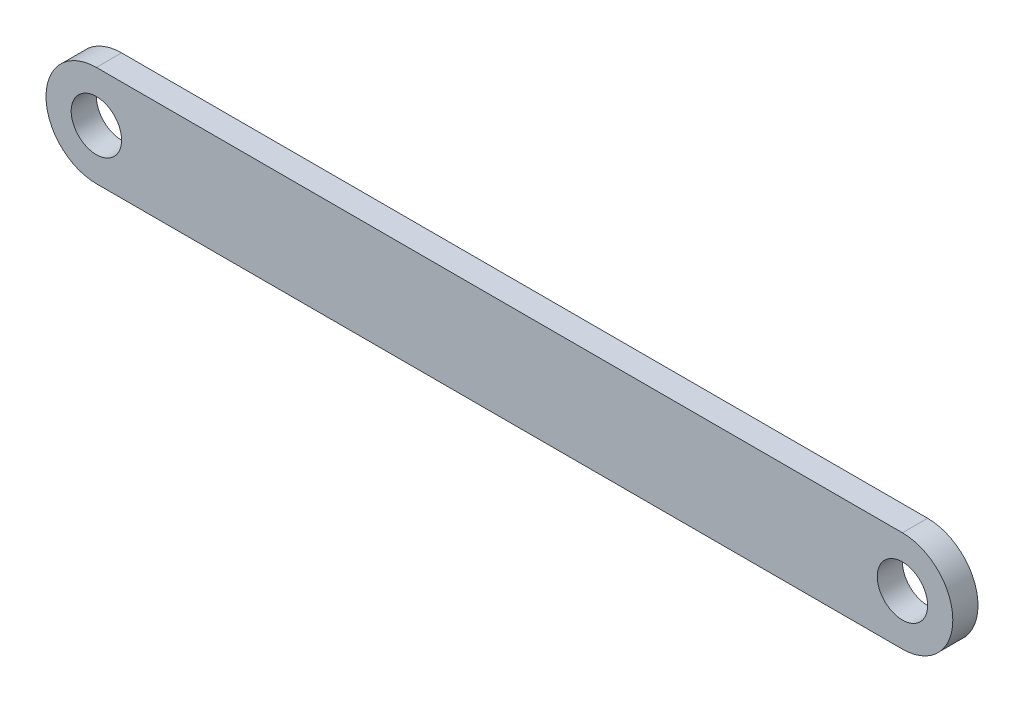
from build123d import *

# Parameters (mm, degrees)
SKETCH1_R      = 6.35
EXTRUDE1_DEPTH = 6.35


with BuildPart() as part:
    # Sketch1 → Extrude1 (new body)
    with BuildSketch(Plane.XY):
        with BuildLine():
            Line((-101.6, 12.7), (101.6, 12.7))
            ThreePointArc((101.6, 12.7), (114.3, 0), (101.6, -12.7))
            Line((101.6, -12.7), (-101.6, -12.7))
            ThreePointArc((-101.6, -12.7), (-114.3, 0), (-101.6, 12.7))
        make_face()
        with Locations((101.6, 0)):
            Circle(SKETCH1_R, mode=Mode.SUBTRACT)
        with Locations((-101.6, 0)):
            Circle(SKETCH1_R, mode=Mode.SUBTRACT)
    extrude(amount=EXTRUDE1_DEPTH)


solid = part.part
